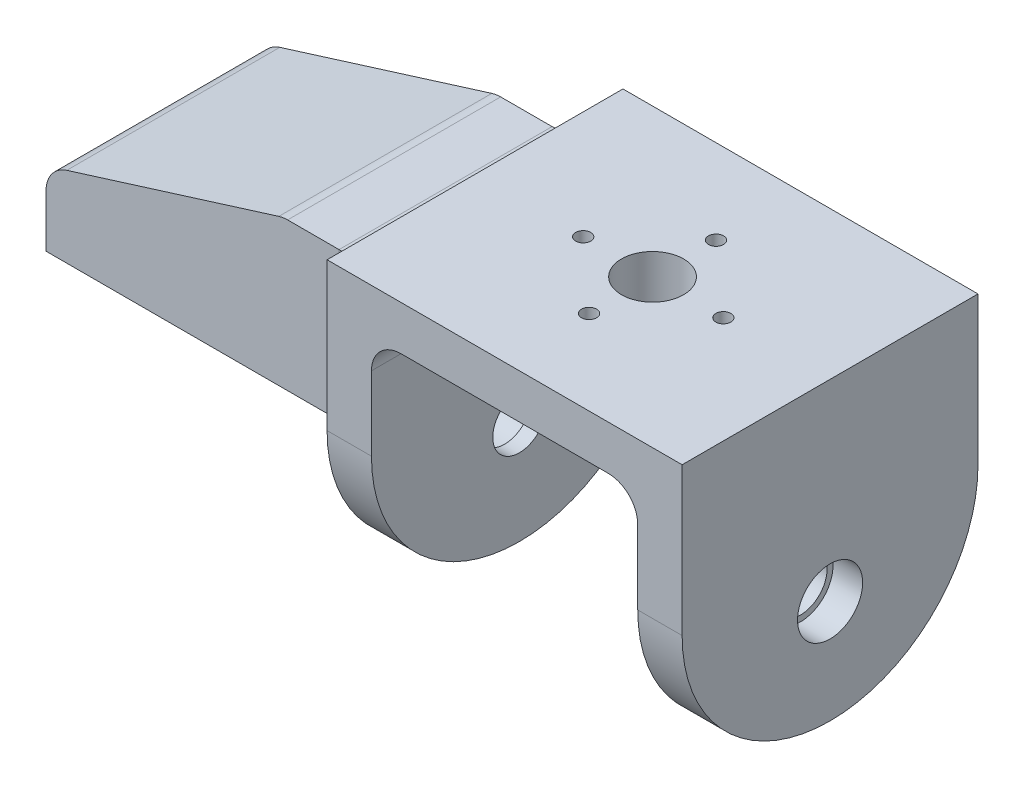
ISO-10303-21;
HEADER;
FILE_DESCRIPTION(('STEP AP214'),'2;1');
FILE_NAME('part.step','',(''),(''),'','','');
FILE_SCHEMA(('AUTOMOTIVE_DESIGN { 1 0 10303 214 1 1 1 1 }'));
ENDSEC;
DATA;
#1=APPLICATION_CONTEXT('core data for automotive mechanical design processes');
#2=APPLICATION_PROTOCOL_DEFINITION('international standard','automotive_design',2000,#1);
#3=PRODUCT_CONTEXT('',#1,'mechanical');
#4=PRODUCT('Part','Part','',(#3));
#5=PRODUCT_RELATED_PRODUCT_CATEGORY('part','',(#4));
#6=PRODUCT_DEFINITION_FORMATION('','',#4);
#7=PRODUCT_DEFINITION_CONTEXT('part definition',#1,'design');
#8=PRODUCT_DEFINITION('design','',#6,#7);
#9=PRODUCT_DEFINITION_SHAPE('','',#8);
#10=(LENGTH_UNIT() NAMED_UNIT(*) SI_UNIT(.MILLI.,.METRE.));
#11=(NAMED_UNIT(*) PLANE_ANGLE_UNIT() SI_UNIT($,.RADIAN.));
#12=(NAMED_UNIT(*) SI_UNIT($,.STERADIAN.) SOLID_ANGLE_UNIT());
#13=UNCERTAINTY_MEASURE_WITH_UNIT(LENGTH_MEASURE(1.E-05),#10,'distance_accuracy_value','');
#14=(GEOMETRIC_REPRESENTATION_CONTEXT(3) GLOBAL_UNCERTAINTY_ASSIGNED_CONTEXT((#13)) GLOBAL_UNIT_ASSIGNED_CONTEXT((#10,
#11,#12)) REPRESENTATION_CONTEXT('',''));
#15=CARTESIAN_POINT('',(0.,0.,0.));
#16=DIRECTION('',(0.,0.,1.));
#17=DIRECTION('',(1.,0.,0.));
#18=AXIS2_PLACEMENT_3D('',#15,#16,#17);
#19=CARTESIAN_POINT('',(120.,-65.,50.));
#20=DIRECTION('',(-1.,0.,0.));
#21=DIRECTION('',(0.,0.,1.));
#22=AXIS2_PLACEMENT_3D('',#19,#20,#21);
#23=CYLINDRICAL_SURFACE('',#22,9.00000000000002);
#24=CARTESIAN_POINT('',(15.,-65.,50.));
#25=DIRECTION('',(-1.,0.,0.));
#26=DIRECTION('',(0.,-1.,0.));
#27=AXIS2_PLACEMENT_3D('',#24,#25,#26);
#28=CIRCLE('',#27,9.00000000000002);
#29=CARTESIAN_POINT('',(15.,-74.,50.));
#30=VERTEX_POINT('',#29);
#31=EDGE_CURVE('E353',#30,#30,#28,.T.);
#32=ORIENTED_EDGE('',*,*,#31,.F.);
#33=EDGE_LOOP('',(#32));
#34=FACE_BOUND('',#33,.T.);
#35=CARTESIAN_POINT('',(10.,-65.,50.));
#36=DIRECTION('',(-1.,0.,0.));
#37=DIRECTION('',(0.,-1.,0.));
#38=AXIS2_PLACEMENT_3D('',#35,#36,#37);
#39=CIRCLE('',#38,9.00000000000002);
#40=CARTESIAN_POINT('',(10.,-74.,50.));
#41=VERTEX_POINT('',#40);
#42=EDGE_CURVE('E489',#41,#41,#39,.F.);
#43=ORIENTED_EDGE('',*,*,#42,.F.);
#44=EDGE_LOOP('',(#43));
#45=FACE_BOUND('',#44,.T.);
#46=ADVANCED_FACE('F53',(#34,#45),#23,.F.);
#47=CARTESIAN_POINT('',(105.,-65.,50.));
#48=DIRECTION('',(1.,0.,0.));
#49=DIRECTION('',(0.,0.,-1.));
#50=AXIS2_PLACEMENT_3D('',#47,#48,#49);
#51=CIRCLE('',#50,9.00000000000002);
#52=CARTESIAN_POINT('',(105.,-65.,41.));
#53=VERTEX_POINT('',#52);
#54=EDGE_CURVE('E320',#53,#53,#51,.T.);
#55=ORIENTED_EDGE('',*,*,#54,.F.);
#56=EDGE_LOOP('',(#55));
#57=FACE_BOUND('',#56,.T.);
#58=CARTESIAN_POINT('',(110.,-65.,50.));
#59=DIRECTION('',(1.,0.,0.));
#60=DIRECTION('',(0.,1.,0.));
#61=AXIS2_PLACEMENT_3D('',#58,#59,#60);
#62=CIRCLE('',#61,9.00000000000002);
#63=CARTESIAN_POINT('',(110.,-56.,50.));
#64=VERTEX_POINT('',#63);
#65=EDGE_CURVE('E483',#64,#64,#62,.F.);
#66=ORIENTED_EDGE('',*,*,#65,.F.);
#67=EDGE_LOOP('',(#66));
#68=FACE_BOUND('',#67,.T.);
#69=ADVANCED_FACE('F612',(#57,#68),#23,.F.);
#70=CARTESIAN_POINT('',(0.,0.,100.));
#71=DIRECTION('',(1.,0.,0.));
#72=DIRECTION('',(0.,1.,0.));
#73=AXIS2_PLACEMENT_3D('',#70,#71,#72);
#74=PLANE('',#73);
#75=CARTESIAN_POINT('',(0.,-65.,50.0000000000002));
#76=DIRECTION('',(-1.,0.,0.));
#77=DIRECTION('',(0.,-1.,0.));
#78=AXIS2_PLACEMENT_3D('',#75,#76,#77);
#79=CIRCLE('',#78,10.9999999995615);
#80=CARTESIAN_POINT('',(0.,-75.9999999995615,50.0000000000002));
#81=VERTEX_POINT('',#80);
#82=EDGE_CURVE('E689',#81,#81,#79,.T.);
#83=ORIENTED_EDGE('',*,*,#82,.F.);
#84=EDGE_LOOP('',(#83));
#85=FACE_BOUND('',#84,.T.);
#86=DIRECTION('',(0.,0.,1.));
#87=VECTOR('',#86,1.);
#88=CARTESIAN_POINT('',(0.,-59.,0.));
#89=LINE('',#88,#87);
#90=CARTESIAN_POINT('',(0.,-59.,4.00000000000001));
#91=VERTEX_POINT('',#90);
#92=CARTESIAN_POINT('',(0.,-59.,27.));
#93=VERTEX_POINT('',#92);
#94=EDGE_CURVE('E261',#91,#93,#89,.T.);
#95=ORIENTED_EDGE('',*,*,#94,.F.);
#96=DIRECTION('',(0.,-1.,0.));
#97=VECTOR('',#96,1.);
#98=CARTESIAN_POINT('',(0.,-9.00000000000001,4.00000000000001));
#99=LINE('',#98,#97);
#100=CARTESIAN_POINT('',(0.,0.,4.00000000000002));
#101=VERTEX_POINT('',#100);
#102=EDGE_CURVE('E508',#91,#101,#99,.F.);
#103=ORIENTED_EDGE('',*,*,#102,.T.);
#104=DIRECTION('',(0.,0.,-1.));
#105=VECTOR('',#104,1.);
#106=CARTESIAN_POINT('',(0.,0.,100.));
#107=LINE('',#106,#105);
#108=CARTESIAN_POINT('',(0.,0.,0.));
#109=VERTEX_POINT('',#108);
#110=EDGE_CURVE('E405',#101,#109,#107,.T.);
#111=ORIENTED_EDGE('',*,*,#110,.T.);
#112=DIRECTION('',(0.,-1.,0.));
#113=VECTOR('',#112,1.);
#114=CARTESIAN_POINT('',(0.,0.,0.));
#115=LINE('',#114,#113);
#116=CARTESIAN_POINT('',(0.,-50.,0.));
#117=VERTEX_POINT('',#116);
#118=EDGE_CURVE('E385',#109,#117,#115,.T.);
#119=ORIENTED_EDGE('',*,*,#118,.T.);
#120=CARTESIAN_POINT('',(0.,-50.,50.));
#121=DIRECTION('',(1.,0.,0.));
#122=DIRECTION('',(0.,1.,0.));
#123=AXIS2_PLACEMENT_3D('',#120,#121,#122);
#124=CIRCLE('',#123,50.);
#125=CARTESIAN_POINT('',(0.,-100.,50.));
#126=VERTEX_POINT('',#125);
#127=EDGE_CURVE('E444',#117,#126,#124,.F.);
#128=ORIENTED_EDGE('',*,*,#127,.T.);
#129=CARTESIAN_POINT('',(0.,-50.,50.));
#130=DIRECTION('',(1.,0.,0.));
#131=DIRECTION('',(0.,1.,0.));
#132=AXIS2_PLACEMENT_3D('',#129,#130,#131);
#133=CIRCLE('',#132,50.);
#134=CARTESIAN_POINT('',(0.,-50.,100.));
#135=VERTEX_POINT('',#134);
#136=EDGE_CURVE('E447',#126,#135,#133,.F.);
#137=ORIENTED_EDGE('',*,*,#136,.T.);
#138=DIRECTION('',(0.,-1.,0.));
#139=VECTOR('',#138,1.);
#140=CARTESIAN_POINT('',(0.,0.,100.));
#141=LINE('',#140,#139);
#142=CARTESIAN_POINT('',(0.,0.,100.));
#143=VERTEX_POINT('',#142);
#144=EDGE_CURVE('E362',#143,#135,#141,.T.);
#145=ORIENTED_EDGE('',*,*,#144,.F.);
#146=CARTESIAN_POINT('',(0.,0.,96.));
#147=VERTEX_POINT('',#146);
#148=EDGE_CURVE('E406',#143,#147,#107,.T.);
#149=ORIENTED_EDGE('',*,*,#148,.T.);
#150=DIRECTION('',(0.,1.,0.));
#151=VECTOR('',#150,1.);
#152=CARTESIAN_POINT('',(0.,-59.,96.));
#153=LINE('',#152,#151);
#154=CARTESIAN_POINT('',(0.,-59.,96.));
#155=VERTEX_POINT('',#154);
#156=EDGE_CURVE('E504',#147,#155,#153,.F.);
#157=ORIENTED_EDGE('',*,*,#156,.T.);
#158=CARTESIAN_POINT('',(0.,-59.,73.));
#159=VERTEX_POINT('',#158);
#160=EDGE_CURVE('E270',#159,#155,#89,.T.);
#161=ORIENTED_EDGE('',*,*,#160,.F.);
#162=DIRECTION('',(0.,1.,0.));
#163=VECTOR('',#162,1.);
#164=CARTESIAN_POINT('',(0.,-59.,73.));
#165=LINE('',#164,#163);
#166=CARTESIAN_POINT('',(0.,-44.,73.));
#167=VERTEX_POINT('',#166);
#168=EDGE_CURVE('E299',#159,#167,#165,.T.);
#169=ORIENTED_EDGE('',*,*,#168,.T.);
#170=DIRECTION('',(0.,0.,1.));
#171=VECTOR('',#170,1.);
#172=CARTESIAN_POINT('',(0.,-44.,14.));
#173=LINE('',#172,#171);
#174=CARTESIAN_POINT('',(0.,-44.,27.));
#175=VERTEX_POINT('',#174);
#176=EDGE_CURVE('E251',#175,#167,#173,.T.);
#177=ORIENTED_EDGE('',*,*,#176,.F.);
#178=DIRECTION('',(0.,1.,0.));
#179=VECTOR('',#178,1.);
#180=CARTESIAN_POINT('',(0.,-59.,27.));
#181=LINE('',#180,#179);
#182=EDGE_CURVE('E296',#93,#175,#181,.T.);
#183=ORIENTED_EDGE('',*,*,#182,.F.);
#184=EDGE_LOOP('',(#95,#103,#111,#119,#128,#137,#145,#149,#157,#161,#169,#177,#183));
#185=FACE_BOUND('',#184,.T.);
#186=ADVANCED_FACE('F638',(#85,#185),#74,.F.);
#187=CARTESIAN_POINT('',(0.,0.,100.));
#188=DIRECTION('',(0.,-1.,0.));
#189=DIRECTION('',(0.,0.,-1.));
#190=AXIS2_PLACEMENT_3D('',#187,#188,#189);
#191=PLANE('',#190);
#192=CARTESIAN_POINT('',(60.,0.,50.));
#193=DIRECTION('',(0.,-1.,0.));
#194=DIRECTION('',(0.,0.,-1.));
#195=AXIS2_PLACEMENT_3D('',#192,#193,#194);
#196=CIRCLE('',#195,10.5);
#197=CARTESIAN_POINT('',(60.,0.,39.5));
#198=VERTEX_POINT('',#197);
#199=EDGE_CURVE('E682',#198,#198,#196,.T.);
#200=ORIENTED_EDGE('',*,*,#199,.T.);
#201=EDGE_LOOP('',(#200));
#202=FACE_BOUND('',#201,.T.);
#203=CARTESIAN_POINT('',(83.95,0.,50.));
#204=DIRECTION('',(0.,-1.,0.));
#205=DIRECTION('',(0.,0.,-1.));
#206=AXIS2_PLACEMENT_3D('',#203,#204,#205);
#207=CIRCLE('',#206,2.55000000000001);
#208=CARTESIAN_POINT('',(83.95,0.,47.45));
#209=VERTEX_POINT('',#208);
#210=EDGE_CURVE('E316',#209,#209,#207,.T.);
#211=ORIENTED_EDGE('',*,*,#210,.T.);
#212=EDGE_LOOP('',(#211));
#213=FACE_BOUND('',#212,.T.);
#214=CARTESIAN_POINT('',(36.55,0.,50.));
#215=DIRECTION('',(0.,-1.,0.));
#216=DIRECTION('',(0.,0.,-1.));
#217=AXIS2_PLACEMENT_3D('',#214,#215,#216);
#218=CIRCLE('',#217,2.54999999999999);
#219=CARTESIAN_POINT('',(36.55,0.,47.45));
#220=VERTEX_POINT('',#219);
#221=EDGE_CURVE('E329',#220,#220,#218,.T.);
#222=ORIENTED_EDGE('',*,*,#221,.T.);
#223=EDGE_LOOP('',(#222));
#224=FACE_BOUND('',#223,.T.);
#225=CARTESIAN_POINT('',(60.,0.,28.55));
#226=DIRECTION('',(0.,-1.,0.));
#227=DIRECTION('',(0.,0.,-1.));
#228=AXIS2_PLACEMENT_3D('',#225,#226,#227);
#229=CIRCLE('',#228,2.55);
#230=CARTESIAN_POINT('',(60.,0.,26.));
#231=VERTEX_POINT('',#230);
#232=EDGE_CURVE('E337',#231,#231,#229,.T.);
#233=ORIENTED_EDGE('',*,*,#232,.T.);
#234=EDGE_LOOP('',(#233));
#235=FACE_BOUND('',#234,.T.);
#236=CARTESIAN_POINT('',(60.,0.,71.45));
#237=DIRECTION('',(0.,-1.,0.));
#238=DIRECTION('',(0.,0.,-1.));
#239=AXIS2_PLACEMENT_3D('',#236,#237,#238);
#240=CIRCLE('',#239,2.55);
#241=CARTESIAN_POINT('',(60.,0.,68.9));
#242=VERTEX_POINT('',#241);
#243=EDGE_CURVE('E345',#242,#242,#240,.T.);
#244=ORIENTED_EDGE('',*,*,#243,.T.);
#245=EDGE_LOOP('',(#244));
#246=FACE_BOUND('',#245,.T.);
#247=DIRECTION('',(-1.,0.,0.));
#248=VECTOR('',#247,1.);
#249=CARTESIAN_POINT('',(0.,0.,0.));
#250=LINE('',#249,#248);
#251=CARTESIAN_POINT('',(120.,0.,0.));
#252=VERTEX_POINT('',#251);
#253=EDGE_CURVE('E357',#252,#109,#250,.T.);
#254=ORIENTED_EDGE('',*,*,#253,.T.);
#255=ORIENTED_EDGE('',*,*,#110,.F.);
#256=EDGE_CURVE('E411',#147,#101,#107,.T.);
#257=ORIENTED_EDGE('',*,*,#256,.F.);
#258=ORIENTED_EDGE('',*,*,#148,.F.);
#259=DIRECTION('',(-1.,0.,0.));
#260=VECTOR('',#259,1.);
#261=CARTESIAN_POINT('',(0.,0.,100.));
#262=LINE('',#261,#260);
#263=CARTESIAN_POINT('',(120.,0.,100.));
#264=VERTEX_POINT('',#263);
#265=EDGE_CURVE('E358',#264,#143,#262,.T.);
#266=ORIENTED_EDGE('',*,*,#265,.F.);
#267=DIRECTION('',(0.,0.,-1.));
#268=VECTOR('',#267,1.);
#269=CARTESIAN_POINT('',(120.,0.,100.));
#270=LINE('',#269,#268);
#271=EDGE_CURVE('E381',#264,#252,#270,.T.);
#272=ORIENTED_EDGE('',*,*,#271,.T.);
#273=EDGE_LOOP('',(#254,#255,#257,#258,#266,#272));
#274=FACE_BOUND('',#273,.T.);
#275=ADVANCED_FACE('F636',(#202,#213,#224,#235,#246,#274),#191,.F.);
#276=CARTESIAN_POINT('',(15.,-100.,100.));
#277=DIRECTION('',(-1.,0.,0.));
#278=DIRECTION('',(0.,-1.,0.));
#279=AXIS2_PLACEMENT_3D('',#276,#277,#278);
#280=PLANE('',#279);
#281=ORIENTED_EDGE('',*,*,#31,.T.);
#282=EDGE_LOOP('',(#281));
#283=FACE_BOUND('',#282,.T.);
#284=DIRECTION('',(0.,1.,0.));
#285=VECTOR('',#284,1.);
#286=CARTESIAN_POINT('',(15.,-100.,0.));
#287=LINE('',#286,#285);
#288=CARTESIAN_POINT('',(15.,-50.,0.));
#289=VERTEX_POINT('',#288);
#290=CARTESIAN_POINT('',(15.,-25.,0.));
#291=VERTEX_POINT('',#290);
#292=EDGE_CURVE('E389',#289,#291,#287,.T.);
#293=ORIENTED_EDGE('',*,*,#292,.T.);
#294=DIRECTION('',(0.,0.,-1.));
#295=VECTOR('',#294,1.);
#296=CARTESIAN_POINT('',(15.,-25.,100.));
#297=LINE('',#296,#295);
#298=CARTESIAN_POINT('',(15.,-25.,100.));
#299=VERTEX_POINT('',#298);
#300=EDGE_CURVE('E467',#291,#299,#297,.F.);
#301=ORIENTED_EDGE('',*,*,#300,.T.);
#302=DIRECTION('',(0.,1.,0.));
#303=VECTOR('',#302,1.);
#304=CARTESIAN_POINT('',(15.,-100.,100.));
#305=LINE('',#304,#303);
#306=CARTESIAN_POINT('',(15.,-50.,100.));
#307=VERTEX_POINT('',#306);
#308=EDGE_CURVE('E367',#307,#299,#305,.T.);
#309=ORIENTED_EDGE('',*,*,#308,.F.);
#310=CARTESIAN_POINT('',(15.,-50.,50.));
#311=DIRECTION('',(-1.,0.,0.));
#312=DIRECTION('',(0.,-1.,0.));
#313=AXIS2_PLACEMENT_3D('',#310,#311,#312);
#314=CIRCLE('',#313,50.);
#315=CARTESIAN_POINT('',(15.,-100.,50.));
#316=VERTEX_POINT('',#315);
#317=EDGE_CURVE('E441',#307,#316,#314,.F.);
#318=ORIENTED_EDGE('',*,*,#317,.T.);
#319=CARTESIAN_POINT('',(15.,-50.,50.));
#320=DIRECTION('',(-1.,0.,0.));
#321=DIRECTION('',(0.,-1.,0.));
#322=AXIS2_PLACEMENT_3D('',#319,#320,#321);
#323=CIRCLE('',#322,50.);
#324=EDGE_CURVE('E438',#316,#289,#323,.F.);
#325=ORIENTED_EDGE('',*,*,#324,.T.);
#326=EDGE_LOOP('',(#293,#301,#309,#318,#325));
#327=FACE_BOUND('',#326,.T.);
#328=ADVANCED_FACE('F632',(#283,#327),#280,.F.);
#329=CARTESIAN_POINT('',(15.,-15.,100.));
#330=DIRECTION('',(0.,1.,0.));
#331=DIRECTION('',(-1.,0.,0.));
#332=AXIS2_PLACEMENT_3D('',#329,#330,#331);
#333=PLANE('',#332);
#334=CARTESIAN_POINT('',(60.,-15.,50.));
#335=DIRECTION('',(0.,-1.,0.));
#336=DIRECTION('',(0.,0.,-1.));
#337=AXIS2_PLACEMENT_3D('',#334,#335,#336);
#338=CIRCLE('',#337,10.5);
#339=CARTESIAN_POINT('',(60.,-15.,39.5));
#340=VERTEX_POINT('',#339);
#341=EDGE_CURVE('E691',#340,#340,#338,.T.);
#342=ORIENTED_EDGE('',*,*,#341,.F.);
#343=EDGE_LOOP('',(#342));
#344=FACE_BOUND('',#343,.T.);
#345=CARTESIAN_POINT('',(83.95,-15.,50.));
#346=DIRECTION('',(0.,-1.,0.));
#347=DIRECTION('',(0.,0.,-1.));
#348=AXIS2_PLACEMENT_3D('',#345,#346,#347);
#349=CIRCLE('',#348,2.55000000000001);
#350=CARTESIAN_POINT('',(83.95,-15.,47.45));
#351=VERTEX_POINT('',#350);
#352=EDGE_CURVE('E321',#351,#351,#349,.T.);
#353=ORIENTED_EDGE('',*,*,#352,.F.);
#354=EDGE_LOOP('',(#353));
#355=FACE_BOUND('',#354,.T.);
#356=CARTESIAN_POINT('',(36.55,-15.,50.));
#357=DIRECTION('',(0.,-1.,0.));
#358=DIRECTION('',(0.,0.,-1.));
#359=AXIS2_PLACEMENT_3D('',#356,#357,#358);
#360=CIRCLE('',#359,2.54999999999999);
#361=CARTESIAN_POINT('',(36.55,-15.,47.45));
#362=VERTEX_POINT('',#361);
#363=EDGE_CURVE('E325',#362,#362,#360,.T.);
#364=ORIENTED_EDGE('',*,*,#363,.F.);
#365=EDGE_LOOP('',(#364));
#366=FACE_BOUND('',#365,.T.);
#367=CARTESIAN_POINT('',(60.,-15.,28.55));
#368=DIRECTION('',(0.,-1.,0.));
#369=DIRECTION('',(0.,0.,-1.));
#370=AXIS2_PLACEMENT_3D('',#367,#368,#369);
#371=CIRCLE('',#370,2.55);
#372=CARTESIAN_POINT('',(60.,-15.,26.));
#373=VERTEX_POINT('',#372);
#374=EDGE_CURVE('E333',#373,#373,#371,.T.);
#375=ORIENTED_EDGE('',*,*,#374,.F.);
#376=EDGE_LOOP('',(#375));
#377=FACE_BOUND('',#376,.T.);
#378=CARTESIAN_POINT('',(60.,-15.,71.45));
#379=DIRECTION('',(0.,-1.,0.));
#380=DIRECTION('',(0.,0.,-1.));
#381=AXIS2_PLACEMENT_3D('',#378,#379,#380);
#382=CIRCLE('',#381,2.55);
#383=CARTESIAN_POINT('',(60.,-15.,68.9));
#384=VERTEX_POINT('',#383);
#385=EDGE_CURVE('E341',#384,#384,#382,.T.);
#386=ORIENTED_EDGE('',*,*,#385,.F.);
#387=EDGE_LOOP('',(#386));
#388=FACE_BOUND('',#387,.T.);
#389=DIRECTION('',(1.,0.,0.));
#390=VECTOR('',#389,1.);
#391=CARTESIAN_POINT('',(15.,-15.,0.));
#392=LINE('',#391,#390);
#393=CARTESIAN_POINT('',(25.,-15.,0.));
#394=VERTEX_POINT('',#393);
#395=CARTESIAN_POINT('',(95.,-15.,0.));
#396=VERTEX_POINT('',#395);
#397=EDGE_CURVE('E393',#394,#396,#392,.T.);
#398=ORIENTED_EDGE('',*,*,#397,.T.);
#399=DIRECTION('',(0.,0.,-1.));
#400=VECTOR('',#399,1.);
#401=CARTESIAN_POINT('',(95.,-15.,100.));
#402=LINE('',#401,#400);
#403=CARTESIAN_POINT('',(95.,-15.,100.));
#404=VERTEX_POINT('',#403);
#405=EDGE_CURVE('E464',#396,#404,#402,.F.);
#406=ORIENTED_EDGE('',*,*,#405,.T.);
#407=DIRECTION('',(1.,0.,0.));
#408=VECTOR('',#407,1.);
#409=CARTESIAN_POINT('',(15.,-15.,100.));
#410=LINE('',#409,#408);
#411=CARTESIAN_POINT('',(25.,-15.,100.));
#412=VERTEX_POINT('',#411);
#413=EDGE_CURVE('E371',#412,#404,#410,.T.);
#414=ORIENTED_EDGE('',*,*,#413,.F.);
#415=DIRECTION('',(0.,0.,-1.));
#416=VECTOR('',#415,1.);
#417=CARTESIAN_POINT('',(25.,-15.,0.));
#418=LINE('',#417,#416);
#419=EDGE_CURVE('E460',#412,#394,#418,.T.);
#420=ORIENTED_EDGE('',*,*,#419,.T.);
#421=EDGE_LOOP('',(#398,#406,#414,#420));
#422=FACE_BOUND('',#421,.T.);
#423=ADVANCED_FACE('F628',(#344,#355,#366,#377,#388,#422),#333,.F.);
#424=CARTESIAN_POINT('',(105.,-100.,100.));
#425=DIRECTION('',(1.,0.,0.));
#426=DIRECTION('',(0.,0.,-1.));
#427=AXIS2_PLACEMENT_3D('',#424,#425,#426);
#428=PLANE('',#427);
#429=ORIENTED_EDGE('',*,*,#54,.T.);
#430=EDGE_LOOP('',(#429));
#431=FACE_BOUND('',#430,.T.);
#432=DIRECTION('',(0.,-1.,0.));
#433=VECTOR('',#432,1.);
#434=CARTESIAN_POINT('',(105.,-100.,100.));
#435=LINE('',#434,#433);
#436=CARTESIAN_POINT('',(105.,-25.,100.));
#437=VERTEX_POINT('',#436);
#438=CARTESIAN_POINT('',(105.,-50.,100.));
#439=VERTEX_POINT('',#438);
#440=EDGE_CURVE('E375',#437,#439,#435,.T.);
#441=ORIENTED_EDGE('',*,*,#440,.F.);
#442=DIRECTION('',(0.,0.,-1.));
#443=VECTOR('',#442,1.);
#444=CARTESIAN_POINT('',(105.,-25.,0.));
#445=LINE('',#444,#443);
#446=CARTESIAN_POINT('',(105.,-25.,0.));
#447=VERTEX_POINT('',#446);
#448=EDGE_CURVE('E450',#437,#447,#445,.T.);
#449=ORIENTED_EDGE('',*,*,#448,.T.);
#450=DIRECTION('',(0.,-1.,0.));
#451=VECTOR('',#450,1.);
#452=CARTESIAN_POINT('',(105.,-100.,0.));
#453=LINE('',#452,#451);
#454=CARTESIAN_POINT('',(105.,-50.,0.));
#455=VERTEX_POINT('',#454);
#456=EDGE_CURVE('E397',#447,#455,#453,.T.);
#457=ORIENTED_EDGE('',*,*,#456,.T.);
#458=CARTESIAN_POINT('',(105.,-50.,50.));
#459=DIRECTION('',(1.,0.,0.));
#460=DIRECTION('',(0.,0.,-1.));
#461=AXIS2_PLACEMENT_3D('',#458,#459,#460);
#462=CIRCLE('',#461,50.);
#463=CARTESIAN_POINT('',(105.,-100.,50.));
#464=VERTEX_POINT('',#463);
#465=EDGE_CURVE('E428',#455,#464,#462,.F.);
#466=ORIENTED_EDGE('',*,*,#465,.T.);
#467=CARTESIAN_POINT('',(105.,-50.,50.));
#468=DIRECTION('',(1.,0.,0.));
#469=DIRECTION('',(0.,0.,-1.));
#470=AXIS2_PLACEMENT_3D('',#467,#468,#469);
#471=CIRCLE('',#470,50.);
#472=EDGE_CURVE('E424',#464,#439,#471,.F.);
#473=ORIENTED_EDGE('',*,*,#472,.T.);
#474=EDGE_LOOP('',(#441,#449,#457,#466,#473));
#475=FACE_BOUND('',#474,.T.);
#476=ADVANCED_FACE('F624',(#431,#475),#428,.F.);
#477=CARTESIAN_POINT('',(120.,0.,100.));
#478=DIRECTION('',(-1.,0.,0.));
#479=DIRECTION('',(0.,-1.,0.));
#480=AXIS2_PLACEMENT_3D('',#477,#478,#479);
#481=PLANE('',#480);
#482=CARTESIAN_POINT('',(120.,-65.,50.0000000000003));
#483=DIRECTION('',(1.,0.,0.));
#484=DIRECTION('',(0.,1.,0.));
#485=AXIS2_PLACEMENT_3D('',#482,#483,#484);
#486=CIRCLE('',#485,11.0000000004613);
#487=CARTESIAN_POINT('',(120.,-53.9999999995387,50.0000000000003));
#488=VERTEX_POINT('',#487);
#489=EDGE_CURVE('E493',#488,#488,#486,.T.);
#490=ORIENTED_EDGE('',*,*,#489,.F.);
#491=EDGE_LOOP('',(#490));
#492=FACE_BOUND('',#491,.T.);
#493=CARTESIAN_POINT('',(120.,-50.,50.));
#494=DIRECTION('',(-1.,0.,0.));
#495=DIRECTION('',(0.,-1.,0.));
#496=AXIS2_PLACEMENT_3D('',#493,#494,#495);
#497=CIRCLE('',#496,50.);
#498=CARTESIAN_POINT('',(120.,-50.,100.));
#499=VERTEX_POINT('',#498);
#500=CARTESIAN_POINT('',(120.,-100.,50.));
#501=VERTEX_POINT('',#500);
#502=EDGE_CURVE('E410',#499,#501,#497,.F.);
#503=ORIENTED_EDGE('',*,*,#502,.T.);
#504=CARTESIAN_POINT('',(120.,-50.,50.));
#505=DIRECTION('',(-1.,0.,0.));
#506=DIRECTION('',(0.,-1.,0.));
#507=AXIS2_PLACEMENT_3D('',#504,#505,#506);
#508=CIRCLE('',#507,50.);
#509=CARTESIAN_POINT('',(120.,-50.,0.));
#510=VERTEX_POINT('',#509);
#511=EDGE_CURVE('E414',#501,#510,#508,.F.);
#512=ORIENTED_EDGE('',*,*,#511,.T.);
#513=DIRECTION('',(0.,1.,0.));
#514=VECTOR('',#513,1.);
#515=CARTESIAN_POINT('',(120.,0.,0.));
#516=LINE('',#515,#514);
#517=EDGE_CURVE('E363',#510,#252,#516,.T.);
#518=ORIENTED_EDGE('',*,*,#517,.T.);
#519=ORIENTED_EDGE('',*,*,#271,.F.);
#520=DIRECTION('',(0.,1.,0.));
#521=VECTOR('',#520,1.);
#522=CARTESIAN_POINT('',(120.,0.,100.));
#523=LINE('',#522,#521);
#524=EDGE_CURVE('E378',#499,#264,#523,.T.);
#525=ORIENTED_EDGE('',*,*,#524,.F.);
#526=EDGE_LOOP('',(#503,#512,#518,#519,#525));
#527=FACE_BOUND('',#526,.T.);
#528=ADVANCED_FACE('F617',(#492,#527),#481,.F.);
#529=CARTESIAN_POINT('',(0.,0.,100.));
#530=DIRECTION('',(0.,0.,-1.));
#531=DIRECTION('',(-1.,0.,0.));
#532=AXIS2_PLACEMENT_3D('',#529,#530,#531);
#533=PLANE('',#532);
#534=ORIENTED_EDGE('',*,*,#413,.T.);
#535=CARTESIAN_POINT('',(95.,-25.,100.));
#536=DIRECTION('',(0.,0.,-1.));
#537=DIRECTION('',(-1.,0.,0.));
#538=AXIS2_PLACEMENT_3D('',#535,#536,#537);
#539=CIRCLE('',#538,10.);
#540=EDGE_CURVE('E473',#404,#437,#539,.T.);
#541=ORIENTED_EDGE('',*,*,#540,.T.);
#542=ORIENTED_EDGE('',*,*,#440,.T.);
#543=DIRECTION('',(1.,0.,0.));
#544=VECTOR('',#543,1.);
#545=CARTESIAN_POINT('',(0.,-50.,100.));
#546=LINE('',#545,#544);
#547=EDGE_CURVE('E435',#439,#499,#546,.T.);
#548=ORIENTED_EDGE('',*,*,#547,.T.);
#549=ORIENTED_EDGE('',*,*,#524,.T.);
#550=ORIENTED_EDGE('',*,*,#265,.T.);
#551=ORIENTED_EDGE('',*,*,#144,.T.);
#552=DIRECTION('',(1.,0.,0.));
#553=VECTOR('',#552,1.);
#554=CARTESIAN_POINT('',(0.,-50.,100.));
#555=LINE('',#554,#553);
#556=EDGE_CURVE('E431',#135,#307,#555,.T.);
#557=ORIENTED_EDGE('',*,*,#556,.T.);
#558=ORIENTED_EDGE('',*,*,#308,.T.);
#559=CARTESIAN_POINT('',(25.,-25.,100.));
#560=DIRECTION('',(0.,0.,-1.));
#561=DIRECTION('',(-1.,0.,0.));
#562=AXIS2_PLACEMENT_3D('',#559,#560,#561);
#563=CIRCLE('',#562,10.);
#564=EDGE_CURVE('E479',#299,#412,#563,.T.);
#565=ORIENTED_EDGE('',*,*,#564,.T.);
#566=EDGE_LOOP('',(#534,#541,#542,#548,#549,#550,#551,#557,#558,#565));
#567=FACE_BOUND('',#566,.T.);
#568=ADVANCED_FACE('F614',(#567),#533,.F.);
#569=CARTESIAN_POINT('',(0.,0.,0.));
#570=DIRECTION('',(0.,0.,-1.));
#571=DIRECTION('',(-1.,0.,0.));
#572=AXIS2_PLACEMENT_3D('',#569,#570,#571);
#573=PLANE('',#572);
#574=ORIENTED_EDGE('',*,*,#517,.F.);
#575=DIRECTION('',(1.,0.,0.));
#576=VECTOR('',#575,1.);
#577=CARTESIAN_POINT('',(105.,-50.,0.));
#578=LINE('',#577,#576);
#579=EDGE_CURVE('E420',#510,#455,#578,.F.);
#580=ORIENTED_EDGE('',*,*,#579,.T.);
#581=ORIENTED_EDGE('',*,*,#456,.F.);
#582=CARTESIAN_POINT('',(95.,-25.,0.));
#583=DIRECTION('',(0.,0.,-1.));
#584=DIRECTION('',(-1.,0.,0.));
#585=AXIS2_PLACEMENT_3D('',#582,#583,#584);
#586=CIRCLE('',#585,10.);
#587=EDGE_CURVE('E470',#447,#396,#586,.F.);
#588=ORIENTED_EDGE('',*,*,#587,.T.);
#589=ORIENTED_EDGE('',*,*,#397,.F.);
#590=CARTESIAN_POINT('',(25.,-25.,0.));
#591=DIRECTION('',(0.,0.,-1.));
#592=DIRECTION('',(-1.,0.,0.));
#593=AXIS2_PLACEMENT_3D('',#590,#591,#592);
#594=CIRCLE('',#593,10.);
#595=EDGE_CURVE('E476',#394,#291,#594,.F.);
#596=ORIENTED_EDGE('',*,*,#595,.T.);
#597=ORIENTED_EDGE('',*,*,#292,.F.);
#598=DIRECTION('',(1.,0.,0.));
#599=VECTOR('',#598,1.);
#600=CARTESIAN_POINT('',(0.,-50.,0.));
#601=LINE('',#600,#599);
#602=EDGE_CURVE('E417',#289,#117,#601,.F.);
#603=ORIENTED_EDGE('',*,*,#602,.T.);
#604=ORIENTED_EDGE('',*,*,#118,.F.);
#605=ORIENTED_EDGE('',*,*,#253,.F.);
#606=EDGE_LOOP('',(#574,#580,#581,#588,#589,#596,#597,#603,#604,#605));
#607=FACE_BOUND('',#606,.T.);
#608=ADVANCED_FACE('F608',(#607),#573,.T.);
#609=CARTESIAN_POINT('',(60.,0.,71.45));
#610=DIRECTION('',(0.,-1.,0.));
#611=DIRECTION('',(0.,0.,-1.));
#612=AXIS2_PLACEMENT_3D('',#609,#610,#611);
#613=CYLINDRICAL_SURFACE('',#612,2.55);
#614=ORIENTED_EDGE('',*,*,#243,.F.);
#615=EDGE_LOOP('',(#614));
#616=FACE_BOUND('',#615,.T.);
#617=ORIENTED_EDGE('',*,*,#385,.T.);
#618=EDGE_LOOP('',(#617));
#619=FACE_BOUND('',#618,.T.);
#620=ADVANCED_FACE('F604',(#616,#619),#613,.F.);
#621=CARTESIAN_POINT('',(60.,0.,28.55));
#622=DIRECTION('',(0.,-1.,0.));
#623=DIRECTION('',(0.,0.,-1.));
#624=AXIS2_PLACEMENT_3D('',#621,#622,#623);
#625=CYLINDRICAL_SURFACE('',#624,2.55);
#626=ORIENTED_EDGE('',*,*,#232,.F.);
#627=EDGE_LOOP('',(#626));
#628=FACE_BOUND('',#627,.T.);
#629=ORIENTED_EDGE('',*,*,#374,.T.);
#630=EDGE_LOOP('',(#629));
#631=FACE_BOUND('',#630,.T.);
#632=ADVANCED_FACE('F600',(#628,#631),#625,.F.);
#633=CARTESIAN_POINT('',(36.55,0.,50.));
#634=DIRECTION('',(0.,-1.,0.));
#635=DIRECTION('',(0.,0.,-1.));
#636=AXIS2_PLACEMENT_3D('',#633,#634,#635);
#637=CYLINDRICAL_SURFACE('',#636,2.54999999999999);
#638=ORIENTED_EDGE('',*,*,#221,.F.);
#639=EDGE_LOOP('',(#638));
#640=FACE_BOUND('',#639,.T.);
#641=ORIENTED_EDGE('',*,*,#363,.T.);
#642=EDGE_LOOP('',(#641));
#643=FACE_BOUND('',#642,.T.);
#644=ADVANCED_FACE('F596',(#640,#643),#637,.F.);
#645=CARTESIAN_POINT('',(83.95,0.,50.));
#646=DIRECTION('',(0.,-1.,0.));
#647=DIRECTION('',(0.,0.,-1.));
#648=AXIS2_PLACEMENT_3D('',#645,#646,#647);
#649=CYLINDRICAL_SURFACE('',#648,2.55000000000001);
#650=ORIENTED_EDGE('',*,*,#210,.F.);
#651=EDGE_LOOP('',(#650));
#652=FACE_BOUND('',#651,.T.);
#653=ORIENTED_EDGE('',*,*,#352,.T.);
#654=EDGE_LOOP('',(#653));
#655=FACE_BOUND('',#654,.T.);
#656=ADVANCED_FACE('F592',(#652,#655),#649,.F.);
#657=CARTESIAN_POINT('',(0.,-50.,50.));
#658=DIRECTION('',(1.,0.,0.));
#659=DIRECTION('',(0.,0.,-1.));
#660=AXIS2_PLACEMENT_3D('',#657,#658,#659);
#661=CYLINDRICAL_SURFACE('',#660,50.);
#662=ORIENTED_EDGE('',*,*,#547,.F.);
#663=ORIENTED_EDGE('',*,*,#472,.F.);
#664=DIRECTION('',(1.,0.,0.));
#665=VECTOR('',#664,1.);
#666=CARTESIAN_POINT('',(120.,-100.,50.));
#667=LINE('',#666,#665);
#668=EDGE_CURVE('E349',#501,#464,#667,.F.);
#669=ORIENTED_EDGE('',*,*,#668,.F.);
#670=ORIENTED_EDGE('',*,*,#502,.F.);
#671=EDGE_LOOP('',(#662,#663,#669,#670));
#672=FACE_BOUND('',#671,.T.);
#673=ADVANCED_FACE('F595',(#672),#661,.T.);
#674=CARTESIAN_POINT('',(120.,-50.,50.));
#675=DIRECTION('',(-1.,0.,0.));
#676=DIRECTION('',(0.,0.,1.));
#677=AXIS2_PLACEMENT_3D('',#674,#675,#676);
#678=CYLINDRICAL_SURFACE('',#677,50.);
#679=ORIENTED_EDGE('',*,*,#465,.F.);
#680=ORIENTED_EDGE('',*,*,#579,.F.);
#681=ORIENTED_EDGE('',*,*,#511,.F.);
#682=ORIENTED_EDGE('',*,*,#668,.T.);
#683=EDGE_LOOP('',(#679,#680,#681,#682));
#684=FACE_BOUND('',#683,.T.);
#685=ADVANCED_FACE('F645',(#684),#678,.T.);
#686=CARTESIAN_POINT('',(0.,-50.,50.));
#687=DIRECTION('',(-1.,0.,0.));
#688=DIRECTION('',(0.,0.,1.));
#689=AXIS2_PLACEMENT_3D('',#686,#687,#688);
#690=CYLINDRICAL_SURFACE('',#689,50.);
#691=DIRECTION('',(1.,0.,0.));
#692=VECTOR('',#691,1.);
#693=CARTESIAN_POINT('',(15.,-100.,50.));
#694=LINE('',#693,#692);
#695=EDGE_CURVE('E312',#126,#316,#694,.T.);
#696=ORIENTED_EDGE('',*,*,#695,.F.);
#697=ORIENTED_EDGE('',*,*,#127,.F.);
#698=ORIENTED_EDGE('',*,*,#602,.F.);
#699=ORIENTED_EDGE('',*,*,#324,.F.);
#700=EDGE_LOOP('',(#696,#697,#698,#699));
#701=FACE_BOUND('',#700,.T.);
#702=ADVANCED_FACE('F648',(#701),#690,.T.);
#703=CARTESIAN_POINT('',(0.,-50.,50.));
#704=DIRECTION('',(1.,0.,0.));
#705=DIRECTION('',(0.,0.,-1.));
#706=AXIS2_PLACEMENT_3D('',#703,#704,#705);
#707=CYLINDRICAL_SURFACE('',#706,50.);
#708=ORIENTED_EDGE('',*,*,#136,.F.);
#709=ORIENTED_EDGE('',*,*,#695,.T.);
#710=ORIENTED_EDGE('',*,*,#317,.F.);
#711=ORIENTED_EDGE('',*,*,#556,.F.);
#712=EDGE_LOOP('',(#708,#709,#710,#711));
#713=FACE_BOUND('',#712,.T.);
#714=ADVANCED_FACE('F653',(#713),#707,.T.);
#715=CARTESIAN_POINT('',(95.,-25.,100.));
#716=DIRECTION('',(0.,0.,1.));
#717=DIRECTION('',(1.,0.,0.));
#718=AXIS2_PLACEMENT_3D('',#715,#716,#717);
#719=CYLINDRICAL_SURFACE('',#718,10.);
#720=ORIENTED_EDGE('',*,*,#540,.F.);
#721=ORIENTED_EDGE('',*,*,#405,.F.);
#722=ORIENTED_EDGE('',*,*,#587,.F.);
#723=ORIENTED_EDGE('',*,*,#448,.F.);
#724=EDGE_LOOP('',(#720,#721,#722,#723));
#725=FACE_BOUND('',#724,.T.);
#726=ADVANCED_FACE('F656',(#725),#719,.F.);
#727=CARTESIAN_POINT('',(25.,-25.,100.));
#728=DIRECTION('',(0.,0.,1.));
#729=DIRECTION('',(1.,0.,0.));
#730=AXIS2_PLACEMENT_3D('',#727,#728,#729);
#731=CYLINDRICAL_SURFACE('',#730,10.);
#732=ORIENTED_EDGE('',*,*,#564,.F.);
#733=ORIENTED_EDGE('',*,*,#300,.F.);
#734=ORIENTED_EDGE('',*,*,#595,.F.);
#735=ORIENTED_EDGE('',*,*,#419,.F.);
#736=EDGE_LOOP('',(#732,#733,#734,#735));
#737=FACE_BOUND('',#736,.T.);
#738=ADVANCED_FACE('F590',(#737),#731,.F.);
#739=CARTESIAN_POINT('',(-109.,-44.,86.));
#740=DIRECTION('',(0.,0.,-1.));
#741=DIRECTION('',(-1.,0.,0.));
#742=AXIS2_PLACEMENT_3D('',#739,#740,#741);
#743=PLANE('',#742);
#744=DIRECTION('',(-1.,0.,0.));
#745=VECTOR('',#744,1.);
#746=CARTESIAN_POINT('',(0.,-59.,86.));
#747=LINE('',#746,#745);
#748=CARTESIAN_POINT('',(-9.99999999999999,-59.,86.));
#749=VERTEX_POINT('',#748);
#750=CARTESIAN_POINT('',(-109.,-59.,86.));
#751=VERTEX_POINT('',#750);
#752=EDGE_CURVE('E276',#749,#751,#747,.T.);
#753=ORIENTED_EDGE('',*,*,#752,.F.);
#754=DIRECTION('',(0.,1.,0.));
#755=VECTOR('',#754,1.);
#756=CARTESIAN_POINT('',(-10.,-8.99999999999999,86.));
#757=LINE('',#756,#755);
#758=CARTESIAN_POINT('',(-9.99999999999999,-9.,86.));
#759=VERTEX_POINT('',#758);
#760=EDGE_CURVE('E517',#749,#759,#757,.T.);
#761=ORIENTED_EDGE('',*,*,#760,.T.);
#762=DIRECTION('',(1.,0.,0.));
#763=VECTOR('',#762,1.);
#764=CARTESIAN_POINT('',(-109.,-9.00000000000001,86.));
#765=LINE('',#764,#763);
#766=CARTESIAN_POINT('',(-27.3295050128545,-9.,86.));
#767=VERTEX_POINT('',#766);
#768=EDGE_CURVE('E290',#767,#759,#765,.T.);
#769=ORIENTED_EDGE('',*,*,#768,.F.);
#770=CARTESIAN_POINT('',(-27.3295050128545,-19.,86.));
#771=DIRECTION('',(0.,0.,-1.));
#772=DIRECTION('',(-1.,0.,0.));
#773=AXIS2_PLACEMENT_3D('',#770,#771,#772);
#774=CIRCLE('',#773,10.);
#775=CARTESIAN_POINT('',(-30.3072677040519,-9.4536431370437,86.));
#776=VERTEX_POINT('',#775);
#777=EDGE_CURVE('E514',#767,#776,#774,.F.);
#778=ORIENTED_EDGE('',*,*,#777,.T.);
#779=DIRECTION('',(0.95463568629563,0.297776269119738,0.));
#780=VECTOR('',#779,1.);
#781=CARTESIAN_POINT('',(-109.,-34.,86.));
#782=LINE('',#781,#780);
#783=CARTESIAN_POINT('',(-101.977762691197,-31.8095773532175,86.));
#784=VERTEX_POINT('',#783);
#785=EDGE_CURVE('E487',#784,#776,#782,.T.);
#786=ORIENTED_EDGE('',*,*,#785,.F.);
#787=CARTESIAN_POINT('',(-99.,-41.3559342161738,86.));
#788=DIRECTION('',(0.,0.,-1.));
#789=DIRECTION('',(-1.,0.,0.));
#790=AXIS2_PLACEMENT_3D('',#787,#788,#789);
#791=CIRCLE('',#790,10.);
#792=CARTESIAN_POINT('',(-109.,-41.3559342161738,86.));
#793=VERTEX_POINT('',#792);
#794=EDGE_CURVE('E511',#784,#793,#791,.F.);
#795=ORIENTED_EDGE('',*,*,#794,.T.);
#796=DIRECTION('',(0.,1.,0.));
#797=VECTOR('',#796,1.);
#798=CARTESIAN_POINT('',(-109.,-44.,86.));
#799=LINE('',#798,#797);
#800=EDGE_CURVE('E305',#751,#793,#799,.T.);
#801=ORIENTED_EDGE('',*,*,#800,.F.);
#802=EDGE_LOOP('',(#753,#761,#769,#778,#786,#795,#801));
#803=FACE_BOUND('',#802,.T.);
#804=ADVANCED_FACE('F586',(#803),#743,.F.);
#805=CARTESIAN_POINT('',(-109.,-44.,14.));
#806=DIRECTION('',(0.,0.,1.));
#807=DIRECTION('',(1.,0.,0.));
#808=AXIS2_PLACEMENT_3D('',#805,#806,#807);
#809=PLANE('',#808);
#810=DIRECTION('',(1.,0.,0.));
#811=VECTOR('',#810,1.);
#812=CARTESIAN_POINT('',(-109.,-9.00000000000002,14.));
#813=LINE('',#812,#811);
#814=CARTESIAN_POINT('',(-27.3295050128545,-9.00000000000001,14.));
#815=VERTEX_POINT('',#814);
#816=CARTESIAN_POINT('',(-9.99999999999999,-9.00000000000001,14.));
#817=VERTEX_POINT('',#816);
#818=EDGE_CURVE('E717',#815,#817,#813,.T.);
#819=ORIENTED_EDGE('',*,*,#818,.T.);
#820=DIRECTION('',(0.,-1.,0.));
#821=VECTOR('',#820,1.);
#822=CARTESIAN_POINT('',(-9.99999999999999,-59.,14.));
#823=LINE('',#822,#821);
#824=CARTESIAN_POINT('',(-10.,-59.,14.));
#825=VERTEX_POINT('',#824);
#826=EDGE_CURVE('E500',#817,#825,#823,.T.);
#827=ORIENTED_EDGE('',*,*,#826,.T.);
#828=DIRECTION('',(1.,0.,0.));
#829=VECTOR('',#828,1.);
#830=CARTESIAN_POINT('',(0.,-59.,14.));
#831=LINE('',#830,#829);
#832=CARTESIAN_POINT('',(-109.,-59.,14.));
#833=VERTEX_POINT('',#832);
#834=EDGE_CURVE('E283',#833,#825,#831,.T.);
#835=ORIENTED_EDGE('',*,*,#834,.F.);
#836=DIRECTION('',(0.,-1.,0.));
#837=VECTOR('',#836,1.);
#838=CARTESIAN_POINT('',(-109.,-44.,14.));
#839=LINE('',#838,#837);
#840=CARTESIAN_POINT('',(-109.,-41.3559342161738,14.));
#841=VERTEX_POINT('',#840);
#842=EDGE_CURVE('E309',#841,#833,#839,.T.);
#843=ORIENTED_EDGE('',*,*,#842,.F.);
#844=CARTESIAN_POINT('',(-99.,-41.3559342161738,14.));
#845=DIRECTION('',(0.,0.,1.));
#846=DIRECTION('',(1.,0.,0.));
#847=AXIS2_PLACEMENT_3D('',#844,#845,#846);
#848=CIRCLE('',#847,10.);
#849=CARTESIAN_POINT('',(-101.977762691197,-31.8095773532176,14.));
#850=VERTEX_POINT('',#849);
#851=EDGE_CURVE('E482',#841,#850,#848,.F.);
#852=ORIENTED_EDGE('',*,*,#851,.T.);
#853=DIRECTION('',(0.95463568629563,0.297776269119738,0.));
#854=VECTOR('',#853,1.);
#855=CARTESIAN_POINT('',(-111.842678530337,-34.8867070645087,14.));
#856=LINE('',#855,#854);
#857=CARTESIAN_POINT('',(-30.3072677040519,-9.45364313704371,14.));
#858=VERTEX_POINT('',#857);
#859=EDGE_CURVE('E713',#850,#858,#856,.T.);
#860=ORIENTED_EDGE('',*,*,#859,.T.);
#861=CARTESIAN_POINT('',(-27.3295050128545,-19.,14.));
#862=DIRECTION('',(0.,0.,1.));
#863=DIRECTION('',(1.,0.,0.));
#864=AXIS2_PLACEMENT_3D('',#861,#862,#863);
#865=CIRCLE('',#864,10.);
#866=EDGE_CURVE('E497',#858,#815,#865,.F.);
#867=ORIENTED_EDGE('',*,*,#866,.T.);
#868=EDGE_LOOP('',(#819,#827,#835,#843,#852,#860,#867));
#869=FACE_BOUND('',#868,.T.);
#870=ADVANCED_FACE('F582',(#869),#809,.F.);
#871=CARTESIAN_POINT('',(-109.,-44.,14.));
#872=DIRECTION('',(0.,1.,0.));
#873=DIRECTION('',(-1.,0.,0.));
#874=AXIS2_PLACEMENT_3D('',#871,#872,#873);
#875=PLANE('',#874);
#876=DIRECTION('',(0.,0.,-1.));
#877=VECTOR('',#876,1.);
#878=CARTESIAN_POINT('',(-96.,-44.,0.));
#879=LINE('',#878,#877);
#880=CARTESIAN_POINT('',(-96.,-44.,73.));
#881=VERTEX_POINT('',#880);
#882=CARTESIAN_POINT('',(-96.,-44.,27.));
#883=VERTEX_POINT('',#882);
#884=EDGE_CURVE('E289',#881,#883,#879,.T.);
#885=ORIENTED_EDGE('',*,*,#884,.T.);
#886=DIRECTION('',(1.,0.,0.));
#887=VECTOR('',#886,1.);
#888=CARTESIAN_POINT('',(0.,-44.,27.));
#889=LINE('',#888,#887);
#890=EDGE_CURVE('E245',#883,#175,#889,.T.);
#891=ORIENTED_EDGE('',*,*,#890,.T.);
#892=ORIENTED_EDGE('',*,*,#176,.T.);
#893=DIRECTION('',(-1.,0.,0.));
#894=VECTOR('',#893,1.);
#895=CARTESIAN_POINT('',(0.,-44.,73.));
#896=LINE('',#895,#894);
#897=EDGE_CURVE('E263',#167,#881,#896,.T.);
#898=ORIENTED_EDGE('',*,*,#897,.T.);
#899=EDGE_LOOP('',(#885,#891,#892,#898));
#900=FACE_BOUND('',#899,.T.);
#901=ADVANCED_FACE('F578',(#900),#875,.F.);
#902=CARTESIAN_POINT('',(-109.,0.,0.));
#903=DIRECTION('',(1.,0.,0.));
#904=DIRECTION('',(0.,1.,0.));
#905=AXIS2_PLACEMENT_3D('',#902,#903,#904);
#906=PLANE('',#905);
#907=ORIENTED_EDGE('',*,*,#800,.T.);
#908=DIRECTION('',(0.,0.,1.));
#909=VECTOR('',#908,1.);
#910=CARTESIAN_POINT('',(-109.,-41.3559342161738,0.));
#911=LINE('',#910,#909);
#912=EDGE_CURVE('E534',#793,#841,#911,.F.);
#913=ORIENTED_EDGE('',*,*,#912,.T.);
#914=ORIENTED_EDGE('',*,*,#842,.T.);
#915=DIRECTION('',(0.,0.,-1.));
#916=VECTOR('',#915,1.);
#917=CARTESIAN_POINT('',(-109.,-59.,0.));
#918=LINE('',#917,#916);
#919=EDGE_CURVE('E279',#751,#833,#918,.T.);
#920=ORIENTED_EDGE('',*,*,#919,.F.);
#921=EDGE_LOOP('',(#907,#913,#914,#920));
#922=FACE_BOUND('',#921,.T.);
#923=ADVANCED_FACE('F575',(#922),#906,.F.);
#924=CARTESIAN_POINT('',(0.,-59.,27.));
#925=DIRECTION('',(0.,0.,1.));
#926=DIRECTION('',(1.,0.,0.));
#927=AXIS2_PLACEMENT_3D('',#924,#925,#926);
#928=PLANE('',#927);
#929=ORIENTED_EDGE('',*,*,#890,.F.);
#930=DIRECTION('',(0.,1.,0.));
#931=VECTOR('',#930,1.);
#932=CARTESIAN_POINT('',(-96.,-59.,27.));
#933=LINE('',#932,#931);
#934=CARTESIAN_POINT('',(-96.,-59.,27.));
#935=VERTEX_POINT('',#934);
#936=EDGE_CURVE('E239',#935,#883,#933,.T.);
#937=ORIENTED_EDGE('',*,*,#936,.F.);
#938=DIRECTION('',(1.,0.,0.));
#939=VECTOR('',#938,1.);
#940=CARTESIAN_POINT('',(0.,-59.,27.));
#941=LINE('',#940,#939);
#942=EDGE_CURVE('E242',#935,#93,#941,.T.);
#943=ORIENTED_EDGE('',*,*,#942,.T.);
#944=ORIENTED_EDGE('',*,*,#182,.T.);
#945=EDGE_LOOP('',(#929,#937,#943,#944));
#946=FACE_BOUND('',#945,.T.);
#947=ADVANCED_FACE('F241',(#946),#928,.T.);
#948=CARTESIAN_POINT('',(-96.,-59.,0.));
#949=DIRECTION('',(1.,0.,0.));
#950=DIRECTION('',(0.,1.,0.));
#951=AXIS2_PLACEMENT_3D('',#948,#949,#950);
#952=PLANE('',#951);
#953=ORIENTED_EDGE('',*,*,#884,.F.);
#954=DIRECTION('',(0.,1.,0.));
#955=VECTOR('',#954,1.);
#956=CARTESIAN_POINT('',(-96.,-59.,73.));
#957=LINE('',#956,#955);
#958=CARTESIAN_POINT('',(-96.,-59.,73.));
#959=VERTEX_POINT('',#958);
#960=EDGE_CURVE('E252',#959,#881,#957,.T.);
#961=ORIENTED_EDGE('',*,*,#960,.F.);
#962=DIRECTION('',(0.,0.,-1.));
#963=VECTOR('',#962,1.);
#964=CARTESIAN_POINT('',(-96.,-59.,0.));
#965=LINE('',#964,#963);
#966=EDGE_CURVE('E258',#959,#935,#965,.T.);
#967=ORIENTED_EDGE('',*,*,#966,.T.);
#968=ORIENTED_EDGE('',*,*,#936,.T.);
#969=EDGE_LOOP('',(#953,#961,#967,#968));
#970=FACE_BOUND('',#969,.T.);
#971=ADVANCED_FACE('F265',(#970),#952,.T.);
#972=CARTESIAN_POINT('',(0.,-59.,73.));
#973=DIRECTION('',(0.,0.,-1.));
#974=DIRECTION('',(-1.,0.,0.));
#975=AXIS2_PLACEMENT_3D('',#972,#973,#974);
#976=PLANE('',#975);
#977=ORIENTED_EDGE('',*,*,#897,.F.);
#978=ORIENTED_EDGE('',*,*,#168,.F.);
#979=DIRECTION('',(-1.,0.,0.));
#980=VECTOR('',#979,1.);
#981=CARTESIAN_POINT('',(0.,-59.,73.));
#982=LINE('',#981,#980);
#983=EDGE_CURVE('E267',#159,#959,#982,.T.);
#984=ORIENTED_EDGE('',*,*,#983,.T.);
#985=ORIENTED_EDGE('',*,*,#960,.T.);
#986=EDGE_LOOP('',(#977,#978,#984,#985));
#987=FACE_BOUND('',#986,.T.);
#988=ADVANCED_FACE('F567',(#987),#976,.T.);
#989=CARTESIAN_POINT('',(0.,-59.,0.));
#990=DIRECTION('',(0.,-1.,0.));
#991=DIRECTION('',(1.,0.,0.));
#992=AXIS2_PLACEMENT_3D('',#989,#990,#991);
#993=PLANE('',#992);
#994=ORIENTED_EDGE('',*,*,#942,.F.);
#995=ORIENTED_EDGE('',*,*,#966,.F.);
#996=ORIENTED_EDGE('',*,*,#983,.F.);
#997=ORIENTED_EDGE('',*,*,#160,.T.);
#998=CARTESIAN_POINT('',(-9.99999999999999,-59.,96.));
#999=DIRECTION('',(0.,-1.,0.));
#1000=DIRECTION('',(1.,0.,0.));
#1001=AXIS2_PLACEMENT_3D('',#998,#999,#1000);
#1002=CIRCLE('',#1001,10.);
#1003=EDGE_CURVE('E545',#155,#749,#1002,.F.);
#1004=ORIENTED_EDGE('',*,*,#1003,.T.);
#1005=ORIENTED_EDGE('',*,*,#752,.T.);
#1006=ORIENTED_EDGE('',*,*,#919,.T.);
#1007=ORIENTED_EDGE('',*,*,#834,.T.);
#1008=CARTESIAN_POINT('',(-9.99999999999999,-59.,4.00000000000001));
#1009=DIRECTION('',(0.,-1.,0.));
#1010=DIRECTION('',(1.,0.,0.));
#1011=AXIS2_PLACEMENT_3D('',#1008,#1009,#1010);
#1012=CIRCLE('',#1011,10.);
#1013=EDGE_CURVE('E537',#825,#91,#1012,.F.);
#1014=ORIENTED_EDGE('',*,*,#1013,.T.);
#1015=ORIENTED_EDGE('',*,*,#94,.T.);
#1016=EDGE_LOOP('',(#994,#995,#996,#997,#1004,#1005,#1006,#1007,#1014,#1015));
#1017=FACE_BOUND('',#1016,.T.);
#1018=ADVANCED_FACE('F256',(#1017),#993,.T.);
#1019=CARTESIAN_POINT('',(-109.,-9.00000000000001,86.));
#1020=DIRECTION('',(0.,-1.,0.));
#1021=DIRECTION('',(1.,0.,0.));
#1022=AXIS2_PLACEMENT_3D('',#1019,#1020,#1021);
#1023=PLANE('',#1022);
#1024=CARTESIAN_POINT('',(-10.,-8.99999999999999,96.));
#1025=DIRECTION('',(0.,-1.,0.));
#1026=DIRECTION('',(1.,0.,0.));
#1027=AXIS2_PLACEMENT_3D('',#1024,#1025,#1026);
#1028=CIRCLE('',#1027,10.);
#1029=CARTESIAN_POINT('',(-9.9498743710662,-9.,86.0001256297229));
#1030=VERTEX_POINT('',#1029);
#1031=EDGE_CURVE('E76',#759,#1030,#1028,.T.);
#1032=ORIENTED_EDGE('',*,*,#1031,.T.);
#1033=CARTESIAN_POINT('',(-9.9498743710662,-9.,86.0001256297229));
#1034=CARTESIAN_POINT('',(-9.9498743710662,-9.,86.));
#1035=B_SPLINE_CURVE_WITH_KNOTS('',1,(#1033,#1034),.UNSPECIFIED.,.F.,.F.,(2,2),(0.,1.),.UNSPECIFIED.);
#1036=CARTESIAN_POINT('',(-9.9498743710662,-9.,86.));
#1037=VERTEX_POINT('',#1036);
#1038=EDGE_CURVE('E12',#1030,#1037,#1035,.T.);
#1039=ORIENTED_EDGE('',*,*,#1038,.T.);
#1040=DIRECTION('',(0.,0.,-1.));
#1041=VECTOR('',#1040,1.);
#1042=CARTESIAN_POINT('',(-9.9498743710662,-9.,86.));
#1043=LINE('',#1042,#1041);
#1044=CARTESIAN_POINT('',(-9.9498743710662,-9.00000000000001,14.));
#1045=VERTEX_POINT('',#1044);
#1046=EDGE_CURVE('E524',#1037,#1045,#1043,.T.);
#1047=ORIENTED_EDGE('',*,*,#1046,.T.);
#1048=CARTESIAN_POINT('',(-9.9498743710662,-9.00000000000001,14.));
#1049=CARTESIAN_POINT('',(-9.9498743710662,-9.00000000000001,13.9998743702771));
#1050=B_SPLINE_CURVE_WITH_KNOTS('',1,(#1048,#1049),.UNSPECIFIED.,.F.,.F.,(2,2),(0.,1.),.UNSPECIFIED.);
#1051=CARTESIAN_POINT('',(-9.9498743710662,-9.00000000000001,13.9998743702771));
#1052=VERTEX_POINT('',#1051);
#1053=EDGE_CURVE('E69',#1045,#1052,#1050,.T.);
#1054=ORIENTED_EDGE('',*,*,#1053,.T.);
#1055=CARTESIAN_POINT('',(-10.,-9.,4.00000000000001));
#1056=DIRECTION('',(0.,-1.,0.));
#1057=DIRECTION('',(1.,0.,0.));
#1058=AXIS2_PLACEMENT_3D('',#1055,#1056,#1057);
#1059=CIRCLE('',#1058,10.);
#1060=EDGE_CURVE('E540',#1052,#817,#1059,.T.);
#1061=ORIENTED_EDGE('',*,*,#1060,.T.);
#1062=ORIENTED_EDGE('',*,*,#818,.F.);
#1063=DIRECTION('',(0.,0.,1.));
#1064=VECTOR('',#1063,1.);
#1065=CARTESIAN_POINT('',(-27.3295050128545,-9.,86.));
#1066=LINE('',#1065,#1064);
#1067=EDGE_CURVE('E520',#815,#767,#1066,.T.);
#1068=ORIENTED_EDGE('',*,*,#1067,.T.);
#1069=ORIENTED_EDGE('',*,*,#768,.T.);
#1070=EDGE_LOOP('',(#1032,#1039,#1047,#1054,#1061,#1062,#1068,#1069));
#1071=FACE_BOUND('',#1070,.T.);
#1072=ADVANCED_FACE('F552',(#1071),#1023,.F.);
#1073=CARTESIAN_POINT('',(-109.,-34.,0.));
#1074=DIRECTION('',(0.297776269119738,-0.95463568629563,0.));
#1075=DIRECTION('',(0.95463568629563,0.297776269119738,0.));
#1076=AXIS2_PLACEMENT_3D('',#1073,#1074,#1075);
#1077=PLANE('',#1076);
#1078=ORIENTED_EDGE('',*,*,#785,.T.);
#1079=DIRECTION('',(0.,0.,1.));
#1080=VECTOR('',#1079,1.);
#1081=CARTESIAN_POINT('',(-30.3072677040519,-9.45364313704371,0.));
#1082=LINE('',#1081,#1080);
#1083=EDGE_CURVE('E531',#776,#858,#1082,.F.);
#1084=ORIENTED_EDGE('',*,*,#1083,.T.);
#1085=ORIENTED_EDGE('',*,*,#859,.F.);
#1086=DIRECTION('',(0.,0.,1.));
#1087=VECTOR('',#1086,1.);
#1088=CARTESIAN_POINT('',(-101.977762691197,-31.8095773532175,0.));
#1089=LINE('',#1088,#1087);
#1090=EDGE_CURVE('E527',#850,#784,#1089,.T.);
#1091=ORIENTED_EDGE('',*,*,#1090,.T.);
#1092=EDGE_LOOP('',(#1078,#1084,#1085,#1091));
#1093=FACE_BOUND('',#1092,.T.);
#1094=ADVANCED_FACE('F562',(#1093),#1077,.F.);
#1095=CARTESIAN_POINT('',(110.,-65.,50.0000000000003));
#1096=DIRECTION('',(1.,0.,0.));
#1097=DIRECTION('',(0.,1.,0.));
#1098=AXIS2_PLACEMENT_3D('',#1095,#1096,#1097);
#1099=PLANE('',#1098);
#1100=CARTESIAN_POINT('',(110.,-65.,50.0000000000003));
#1101=DIRECTION('',(1.,0.,0.));
#1102=DIRECTION('',(0.,1.,0.));
#1103=AXIS2_PLACEMENT_3D('',#1100,#1101,#1102);
#1104=CIRCLE('',#1103,11.0000000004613);
#1105=CARTESIAN_POINT('',(110.,-53.9999999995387,50.0000000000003));
#1106=VERTEX_POINT('',#1105);
#1107=EDGE_CURVE('E488',#1106,#1106,#1104,.T.);
#1108=ORIENTED_EDGE('',*,*,#1107,.T.);
#1109=EDGE_LOOP('',(#1108));
#1110=FACE_BOUND('',#1109,.T.);
#1111=ORIENTED_EDGE('',*,*,#65,.T.);
#1112=EDGE_LOOP('',(#1111));
#1113=FACE_BOUND('',#1112,.T.);
#1114=ADVANCED_FACE('F822',(#1110,#1113),#1099,.T.);
#1115=CARTESIAN_POINT('',(110.,-65.,50.0000000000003));
#1116=DIRECTION('',(1.,0.,0.));
#1117=DIRECTION('',(0.,1.,0.));
#1118=AXIS2_PLACEMENT_3D('',#1115,#1116,#1117);
#1119=CYLINDRICAL_SURFACE('',#1118,11.0000000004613);
#1120=ORIENTED_EDGE('',*,*,#1107,.F.);
#1121=EDGE_LOOP('',(#1120));
#1122=FACE_BOUND('',#1121,.T.);
#1123=ORIENTED_EDGE('',*,*,#489,.T.);
#1124=EDGE_LOOP('',(#1123));
#1125=FACE_BOUND('',#1124,.T.);
#1126=ADVANCED_FACE('F816',(#1122,#1125),#1119,.F.);
#1127=CARTESIAN_POINT('',(10.,-65.,50.0000000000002));
#1128=DIRECTION('',(-1.,0.,0.));
#1129=DIRECTION('',(0.,-1.,0.));
#1130=AXIS2_PLACEMENT_3D('',#1127,#1128,#1129);
#1131=PLANE('',#1130);
#1132=CARTESIAN_POINT('',(10.,-65.,50.0000000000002));
#1133=DIRECTION('',(-1.,0.,0.));
#1134=DIRECTION('',(0.,-1.,0.));
#1135=AXIS2_PLACEMENT_3D('',#1132,#1133,#1134);
#1136=CIRCLE('',#1135,10.9999999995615);
#1137=CARTESIAN_POINT('',(10.,-75.9999999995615,50.0000000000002));
#1138=VERTEX_POINT('',#1137);
#1139=EDGE_CURVE('E494',#1138,#1138,#1136,.T.);
#1140=ORIENTED_EDGE('',*,*,#1139,.T.);
#1141=EDGE_LOOP('',(#1140));
#1142=FACE_BOUND('',#1141,.T.);
#1143=ORIENTED_EDGE('',*,*,#42,.T.);
#1144=EDGE_LOOP('',(#1143));
#1145=FACE_BOUND('',#1144,.T.);
#1146=ADVANCED_FACE('F810',(#1142,#1145),#1131,.T.);
#1147=CARTESIAN_POINT('',(10.,-65.,50.0000000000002));
#1148=DIRECTION('',(-1.,0.,0.));
#1149=DIRECTION('',(0.,-1.,0.));
#1150=AXIS2_PLACEMENT_3D('',#1147,#1148,#1149);
#1151=CYLINDRICAL_SURFACE('',#1150,10.9999999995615);
#1152=ORIENTED_EDGE('',*,*,#1139,.F.);
#1153=EDGE_LOOP('',(#1152));
#1154=FACE_BOUND('',#1153,.T.);
#1155=ORIENTED_EDGE('',*,*,#82,.T.);
#1156=EDGE_LOOP('',(#1155));
#1157=FACE_BOUND('',#1156,.T.);
#1158=ADVANCED_FACE('F805',(#1154,#1157),#1151,.F.);
#1159=CARTESIAN_POINT('',(-9.99999999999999,-44.,96.));
#1160=DIRECTION('',(0.,-1.,0.));
#1161=DIRECTION('',(1.,0.,0.));
#1162=AXIS2_PLACEMENT_3D('',#1159,#1160,#1161);
#1163=CYLINDRICAL_SURFACE('',#1162,10.);
#1164=ORIENTED_EDGE('',*,*,#1003,.F.);
#1165=ORIENTED_EDGE('',*,*,#156,.F.);
#1166=CARTESIAN_POINT('',(-9.9498743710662,-9.,86.0001256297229));
#1167=CARTESIAN_POINT('',(-9.83758562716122,-9.00000164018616,86.0006868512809));
#1168=CARTESIAN_POINT('',(-9.72532393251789,-8.99810812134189,86.0031431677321));
#1169=CARTESIAN_POINT('',(-9.50108036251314,-8.99055384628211,86.0118236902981));
#1170=CARTESIAN_POINT('',(-9.3890984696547,-8.98489333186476,86.0180476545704));
#1171=CARTESIAN_POINT('',(-9.05412266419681,-8.96231127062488,86.0423211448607));
#1172=CARTESIAN_POINT('',(-8.83186330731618,-8.93978910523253,86.0659735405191));
#1173=CARTESIAN_POINT('',(-8.39322523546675,-8.88055891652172,86.1274651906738));
#1174=CARTESIAN_POINT('',(-8.17681281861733,-8.84397155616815,86.1651836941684));
#1175=CARTESIAN_POINT('',(-7.74949361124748,-8.75734871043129,86.2540854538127));
#1176=CARTESIAN_POINT('',(-7.53858763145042,-8.70731125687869,86.3052706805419));
#1177=CARTESIAN_POINT('',(-7.12432467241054,-8.5949047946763,86.4199920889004));
#1178=CARTESIAN_POINT('',(-6.92094599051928,-8.5325751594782,86.4834888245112));
#1179=CARTESIAN_POINT('',(-6.52199487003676,-8.39649328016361,86.6219358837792));
#1180=CARTESIAN_POINT('',(-6.32642541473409,-8.32273672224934,86.6968905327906));
#1181=CARTESIAN_POINT('',(-5.94363134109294,-8.16476717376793,86.8572975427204));
#1182=CARTESIAN_POINT('',(-5.75641996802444,-8.08053833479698,86.9427658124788));
#1183=CARTESIAN_POINT('',(-5.39113684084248,-7.90276326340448,87.1230698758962));
#1184=CARTESIAN_POINT('',(-5.2130672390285,-7.80921485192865,87.2179078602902));
#1185=CARTESIAN_POINT('',(-4.7952913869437,-7.57373798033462,87.456567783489));
#1186=CARTESIAN_POINT('',(-4.56024922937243,-7.4276997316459,87.6045303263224));
#1187=CARTESIAN_POINT('',(-4.10935617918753,-7.12173774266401,87.9145061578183));
#1188=CARTESIAN_POINT('',(-3.89350712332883,-6.96181267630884,88.0765207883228));
#1189=CARTESIAN_POINT('',(-3.48026469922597,-6.62984864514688,88.4128904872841));
#1190=CARTESIAN_POINT('',(-3.28292678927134,-6.45777582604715,88.5872800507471));
#1191=CARTESIAN_POINT('',(-2.90707217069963,-6.10391229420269,88.9460730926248));
#1192=CARTESIAN_POINT('',(-2.72855541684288,-5.922121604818,89.130476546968));
#1193=CARTESIAN_POINT('',(-2.32395212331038,-5.47821382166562,89.5811000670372));
#1194=CARTESIAN_POINT('',(-2.10634822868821,-5.21234108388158,89.8512602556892));
#1195=CARTESIAN_POINT('',(-1.70492397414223,-4.66877513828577,90.4045883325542));
#1196=CARTESIAN_POINT('',(-1.52112047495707,-4.39107611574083,90.687762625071));
#1197=CARTESIAN_POINT('',(-1.18692155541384,-3.82876849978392,91.2629491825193));
#1198=CARTESIAN_POINT('',(-1.03634387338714,-3.54420760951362,91.5549027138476));
#1199=CARTESIAN_POINT('',(-0.76614840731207,-2.9698577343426,92.14746432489));
#1200=CARTESIAN_POINT('',(-0.646513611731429,-2.68007171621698,92.4480675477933));
#1201=CARTESIAN_POINT('',(-0.468690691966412,-2.18648394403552,92.9660442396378));
#1202=CARTESIAN_POINT('',(-0.40284944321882,-1.98308329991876,93.1812045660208));
#1203=CARTESIAN_POINT('',(-0.314433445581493,-1.67763872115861,93.5094441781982));
#1204=CARTESIAN_POINT('',(-0.286525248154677,-1.57503606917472,93.6205839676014));
#1205=CARTESIAN_POINT('',(-0.234407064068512,-1.3708181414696,93.844449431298));
#1206=CARTESIAN_POINT('',(-0.210193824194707,-1.26920207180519,93.9571736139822));
#1207=CARTESIAN_POINT('',(-0.165026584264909,-1.06586387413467,94.1869178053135));
#1208=CARTESIAN_POINT('',(-0.144139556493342,-0.964173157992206,94.3039786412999));
#1209=CARTESIAN_POINT('',(-0.106117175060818,-0.763757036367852,94.542033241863));
#1210=CARTESIAN_POINT('',(-0.0889954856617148,-0.665043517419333,94.663039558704));
#1211=CARTESIAN_POINT('',(-0.0592229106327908,-0.477735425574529,94.9065739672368));
#1212=CARTESIAN_POINT('',(-0.0464407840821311,-0.388911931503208,95.0289132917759));
#1213=CARTESIAN_POINT('',(-0.0249265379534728,-0.225527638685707,95.2830108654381));
#1214=CARTESIAN_POINT('',(-0.0161636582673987,-0.150861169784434,95.4146883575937));
#1215=CARTESIAN_POINT('',(-0.00838511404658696,-0.0802903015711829,95.5891060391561));
#1216=CARTESIAN_POINT('',(-0.0069850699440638,-0.0672840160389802,95.6245794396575));
#1217=CARTESIAN_POINT('',(-0.00454227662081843,-0.0442674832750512,95.6964794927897));
#1218=CARTESIAN_POINT('',(-0.00349925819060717,-0.0342549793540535,95.732905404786));
#1219=CARTESIAN_POINT('',(-0.00178387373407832,-0.0176315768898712,95.8074233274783));
#1220=CARTESIAN_POINT('',(-0.00112043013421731,-0.0111027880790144,95.8455343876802));
#1221=CARTESIAN_POINT('',(-0.000225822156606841,-0.00224721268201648,95.9224128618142));
#1222=CARTESIAN_POINT('',(3.381618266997E-06,6.05141007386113E-05,95.9611824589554));
#1223=CARTESIAN_POINT('',(0.,-2.55693851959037E-12,96.000000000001));
#1224=B_SPLINE_CURVE_WITH_KNOTS('',3,(#1166,#1167,#1168,#1169,#1170,#1171,#1172,#1173,#1174,
#1175,#1176,#1177,#1178,#1179,#1180,#1181,#1182,#1183,#1184,#1185,#1186,#1187,#1188,#1189,#1190,
#1191,#1192,#1193,#1194,#1195,#1196,#1197,#1198,#1199,#1200,#1201,#1202,#1203,#1204,#1205,#1206,
#1207,#1208,#1209,#1210,#1211,#1212,#1213,#1214,#1215,#1216,#1217,#1218,#1219,#1220,#1221,#1222,
#1223),.UNSPECIFIED.,.F.,.F.,(4,2,2,2,2,2,2,2,2,2,2,2,2,2,2,2,2,2,2,2,2,2,2,2,2,2,2,2,4),(0.,
0.336803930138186,0.673586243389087,1.3464477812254,2.01366132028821,2.68097254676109,
3.3461800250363,4.01163924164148,4.67811808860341,5.34475313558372,6.28472133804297,
7.22477939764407,8.16756942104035,9.11035717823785,10.4196203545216,11.7295348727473,
13.0320745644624,14.3338966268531,15.2434664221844,15.7048585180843,16.1658420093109,
16.6351746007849,17.1061832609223,17.5613161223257,18.0129051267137,18.1262138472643,
18.239436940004,18.3552223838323,18.4715293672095),.UNSPECIFIED.);
#1225=EDGE_CURVE('E57',#1030,#147,#1224,.T.);
#1226=ORIENTED_EDGE('',*,*,#1225,.F.);
#1227=ORIENTED_EDGE('',*,*,#1031,.F.);
#1228=ORIENTED_EDGE('',*,*,#760,.F.);
#1229=EDGE_LOOP('',(#1164,#1165,#1226,#1227,#1228));
#1230=FACE_BOUND('',#1229,.T.);
#1231=ADVANCED_FACE('F671',(#1230),#1163,.F.);
#1232=CARTESIAN_POINT('',(-9.9498743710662,1.,100.));
#1233=DIRECTION('',(0.,0.,-1.));
#1234=DIRECTION('',(-1.,0.,0.));
#1235=AXIS2_PLACEMENT_3D('',#1232,#1233,#1234);
#1236=CYLINDRICAL_SURFACE('',#1235,10.);
#1237=ORIENTED_EDGE('',*,*,#1225,.T.);
#1238=ORIENTED_EDGE('',*,*,#256,.T.);
#1239=CARTESIAN_POINT('',(0.,0.,4.00000000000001));
#1240=CARTESIAN_POINT('',(1.88461520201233E-05,0.000361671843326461,4.07430669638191));
#1241=CARTESIAN_POINT('',(-0.000826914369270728,-0.00828093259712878,4.14778606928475));
#1242=CARTESIAN_POINT('',(-0.00396737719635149,-0.038859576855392,4.2901148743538));
#1243=CARTESIAN_POINT('',(-0.00622566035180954,-0.06046094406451,4.35903391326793));
#1244=CARTESIAN_POINT('',(-0.0122680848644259,-0.115705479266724,4.50089937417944));
#1245=CARTESIAN_POINT('',(-0.0161997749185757,-0.150461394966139,4.57337433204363));
#1246=CARTESIAN_POINT('',(-0.0253214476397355,-0.226679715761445,4.71469586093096));
#1247=CARTESIAN_POINT('',(-0.0305140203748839,-0.268155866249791,4.7835346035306));
#1248=CARTESIAN_POINT('',(-0.0421591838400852,-0.356168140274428,4.91988816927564));
#1249=CARTESIAN_POINT('',(-0.0486368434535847,-0.402795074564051,4.98734113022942));
#1250=CARTESIAN_POINT('',(-0.0627019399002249,-0.49872715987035,5.12006368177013));
#1251=CARTESIAN_POINT('',(-0.0702882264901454,-0.548029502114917,5.18533545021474));
#1252=CARTESIAN_POINT('',(-0.096642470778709,-0.710774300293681,5.39458295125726));
#1253=CARTESIAN_POINT('',(-0.117586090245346,-0.827753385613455,5.53551818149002));
#1254=CARTESIAN_POINT('',(-0.164763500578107,-1.06552937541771,5.81325207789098));
#1255=CARTESIAN_POINT('',(-0.191000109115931,-1.18632828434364,5.95004849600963));
#1256=CARTESIAN_POINT('',(-0.248795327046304,-1.42997081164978,6.2210901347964));
#1257=CARTESIAN_POINT('',(-0.280362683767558,-1.55281748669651,6.35533075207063));
#1258=CARTESIAN_POINT('',(-0.348802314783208,-1.7992477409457,6.62169158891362));
#1259=CARTESIAN_POINT('',(-0.38567337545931,-1.92283114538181,6.75381228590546));
#1260=CARTESIAN_POINT('',(-0.503663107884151,-2.29170514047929,7.14540639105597));
#1261=CARTESIAN_POINT('',(-0.59264384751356,-2.53719414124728,7.40237620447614));
#1262=CARTESIAN_POINT('',(-0.792085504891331,-3.02548110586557,7.91005833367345));
#1263=CARTESIAN_POINT('',(-0.902530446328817,-3.26828093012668,8.16077514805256));
#1264=CARTESIAN_POINT('',(-1.14609182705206,-3.75043765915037,8.65670969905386));
#1265=CARTESIAN_POINT('',(-1.27930013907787,-3.98977617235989,8.90190040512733));
#1266=CARTESIAN_POINT('',(-1.56887015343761,-4.46219361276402,9.3847286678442));
#1267=CARTESIAN_POINT('',(-1.72523818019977,-4.69527080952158,9.62236413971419));
#1268=CARTESIAN_POINT('',(-2.06214143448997,-5.15342368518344,10.08878184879));
#1269=CARTESIAN_POINT('',(-2.24270470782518,-5.37848968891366,10.3175534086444));
#1270=CARTESIAN_POINT('',(-2.62870506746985,-5.81806394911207,10.7639510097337));
#1271=CARTESIAN_POINT('',(-2.83413443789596,-6.03257545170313,10.981580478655));
#1272=CARTESIAN_POINT('',(-3.21992612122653,-6.40008990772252,11.354240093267));
#1273=CARTESIAN_POINT('',(-3.39501831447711,-6.55580145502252,11.5120639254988));
#1274=CARTESIAN_POINT('',(-3.76063473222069,-6.85808919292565,11.8183878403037));
#1275=CARTESIAN_POINT('',(-3.9511586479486,-7.00466556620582,11.9668881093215));
#1276=CARTESIAN_POINT('',(-4.34755122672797,-7.28692420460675,12.2528470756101));
#1277=CARTESIAN_POINT('',(-4.55340333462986,-7.42261790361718,12.390317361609));
#1278=CARTESIAN_POINT('',(-4.98048292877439,-7.68144287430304,12.6525833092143));
#1279=CARTESIAN_POINT('',(-5.20170559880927,-7.80457805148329,12.7773829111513));
#1280=CARTESIAN_POINT('',(-5.61588472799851,-8.01442122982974,12.9901634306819));
#1281=CARTESIAN_POINT('',(-5.80629666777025,-8.10361827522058,13.0806479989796));
#1282=CARTESIAN_POINT('',(-6.19635382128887,-8.27125149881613,13.2508113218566));
#1283=CARTESIAN_POINT('',(-6.39599379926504,-8.34969368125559,13.330496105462));
#1284=CARTESIAN_POINT('',(-6.80348954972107,-8.49457451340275,13.4778258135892));
#1285=CARTESIAN_POINT('',(-7.01133100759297,-8.56103303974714,13.5454906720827));
#1286=CARTESIAN_POINT('',(-7.43445873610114,-8.68096091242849,13.6678054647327));
#1287=CARTESIAN_POINT('',(-7.64974351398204,-8.73443284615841,13.7224579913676));
#1288=CARTESIAN_POINT('',(-8.03614504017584,-8.81667972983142,13.8067782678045));
#1289=CARTESIAN_POINT('',(-8.20604055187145,-8.84830630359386,13.8393014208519));
#1290=CARTESIAN_POINT('',(-8.54862792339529,-8.90285746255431,13.8956377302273));
#1291=CARTESIAN_POINT('',(-8.72131918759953,-8.92578387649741,13.9194527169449));
#1292=CARTESIAN_POINT('',(-9.06942016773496,-8.96270726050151,13.9581519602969));
#1293=CARTESIAN_POINT('',(-9.24483844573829,-8.97666491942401,13.9729968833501));
#1294=CARTESIAN_POINT('',(-9.5967833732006,-8.99532465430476,13.9934289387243));
#1295=CARTESIAN_POINT('',(-9.77331049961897,-9.00002242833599,13.9990117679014));
#1296=CARTESIAN_POINT('',(-9.9498743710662,-9.,13.9998743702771));
#1297=B_SPLINE_CURVE_WITH_KNOTS('',3,(#1239,#1240,#1241,#1242,#1243,#1244,#1245,#1246,#1247,
#1248,#1249,#1250,#1251,#1252,#1253,#1254,#1255,#1256,#1257,#1258,#1259,#1260,#1261,#1262,#1263,
#1264,#1265,#1266,#1267,#1268,#1269,#1270,#1271,#1272,#1273,#1274,#1275,#1276,#1277,#1278,#1279,
#1280,#1281,#1282,#1283,#1284,#1285,#1286,#1287,#1288,#1289,#1290,#1291,#1292,#1293,#1294,#1295,
#1296),.UNSPECIFIED.,.F.,.F.,(4,2,2,2,2,2,2,2,2,2,2,2,2,2,2,2,2,2,2,2,2,2,2,2,2,2,2,2,4),(0.,
0.221136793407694,0.436794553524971,0.677670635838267,0.919045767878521,1.16569881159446,
1.41209773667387,1.96483376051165,2.51786480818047,3.07181231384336,3.62563326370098,
4.72396281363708,5.82147796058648,6.92353206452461,8.02588767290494,9.12953230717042,
10.232835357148,11.0797227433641,11.9265931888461,12.7725618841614,13.6182666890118,
14.3043697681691,14.9900882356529,15.6746586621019,16.3590925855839,16.8862150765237,
17.4132267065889,17.9425328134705,18.4720847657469),.UNSPECIFIED.);
#1298=EDGE_CURVE('E675',#1052,#101,#1297,.F.);
#1299=ORIENTED_EDGE('',*,*,#1298,.F.);
#1300=ORIENTED_EDGE('',*,*,#1053,.F.);
#1301=ORIENTED_EDGE('',*,*,#1046,.F.);
#1302=ORIENTED_EDGE('',*,*,#1038,.F.);
#1303=EDGE_LOOP('',(#1237,#1238,#1299,#1300,#1301,#1302));
#1304=FACE_BOUND('',#1303,.T.);
#1305=ADVANCED_FACE('F666',(#1304),#1236,.F.);
#1306=CARTESIAN_POINT('',(-9.99999999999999,-44.,4.00000000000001));
#1307=DIRECTION('',(0.,1.,0.));
#1308=DIRECTION('',(-1.,0.,0.));
#1309=AXIS2_PLACEMENT_3D('',#1306,#1307,#1308);
#1310=CYLINDRICAL_SURFACE('',#1309,10.);
#1311=ORIENTED_EDGE('',*,*,#1298,.T.);
#1312=ORIENTED_EDGE('',*,*,#102,.F.);
#1313=ORIENTED_EDGE('',*,*,#1013,.F.);
#1314=ORIENTED_EDGE('',*,*,#826,.F.);
#1315=ORIENTED_EDGE('',*,*,#1060,.F.);
#1316=EDGE_LOOP('',(#1311,#1312,#1313,#1314,#1315));
#1317=FACE_BOUND('',#1316,.T.);
#1318=ADVANCED_FACE('F670',(#1317),#1310,.F.);
#1319=CARTESIAN_POINT('',(-27.3295050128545,-19.,86.));
#1320=DIRECTION('',(0.,0.,1.));
#1321=DIRECTION('',(1.,0.,0.));
#1322=AXIS2_PLACEMENT_3D('',#1319,#1320,#1321);
#1323=CYLINDRICAL_SURFACE('',#1322,10.);
#1324=ORIENTED_EDGE('',*,*,#866,.F.);
#1325=ORIENTED_EDGE('',*,*,#1083,.F.);
#1326=ORIENTED_EDGE('',*,*,#777,.F.);
#1327=ORIENTED_EDGE('',*,*,#1067,.F.);
#1328=EDGE_LOOP('',(#1324,#1325,#1326,#1327));
#1329=FACE_BOUND('',#1328,.T.);
#1330=ADVANCED_FACE('F737',(#1329),#1323,.T.);
#1331=CARTESIAN_POINT('',(-99.,-41.3559342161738,0.));
#1332=DIRECTION('',(0.,0.,1.));
#1333=DIRECTION('',(1.,0.,0.));
#1334=AXIS2_PLACEMENT_3D('',#1331,#1332,#1333);
#1335=CYLINDRICAL_SURFACE('',#1334,10.);
#1336=ORIENTED_EDGE('',*,*,#851,.F.);
#1337=ORIENTED_EDGE('',*,*,#912,.F.);
#1338=ORIENTED_EDGE('',*,*,#794,.F.);
#1339=ORIENTED_EDGE('',*,*,#1090,.F.);
#1340=EDGE_LOOP('',(#1336,#1337,#1338,#1339));
#1341=FACE_BOUND('',#1340,.T.);
#1342=ADVANCED_FACE('F55',(#1341),#1335,.T.);
#1343=CARTESIAN_POINT('',(60.,0.884650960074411,50.));
#1344=DIRECTION('',(0.,-1.,0.));
#1345=DIRECTION('',(0.,0.,-1.));
#1346=AXIS2_PLACEMENT_3D('',#1343,#1344,#1345);
#1347=CYLINDRICAL_SURFACE('',#1346,10.5);
#1348=ORIENTED_EDGE('',*,*,#341,.T.);
#1349=EDGE_LOOP('',(#1348));
#1350=FACE_BOUND('',#1349,.T.);
#1351=ORIENTED_EDGE('',*,*,#199,.F.);
#1352=EDGE_LOOP('',(#1351));
#1353=FACE_BOUND('',#1352,.T.);
#1354=ADVANCED_FACE('F793',(#1350,#1353),#1347,.F.);
#1355=CLOSED_SHELL('',(#46,#69,#186,#275,#328,#423,#476,#528,#568,#608,#620,#632,#644,#656,#673,
#685,#702,#714,#726,#738,#804,#870,#901,#923,#947,#971,#988,#1018,#1072,#1094,#1114,#1126,#1146,
#1158,#1231,#1305,#1318,#1330,#1342,#1354));
#1356=MANIFOLD_SOLID_BREP('B2',#1355);
#1357=ADVANCED_BREP_SHAPE_REPRESENTATION('',(#18,#1356),#14);
#1358=SHAPE_DEFINITION_REPRESENTATION(#9,#1357);
ENDSEC;
END-ISO-10303-21;
